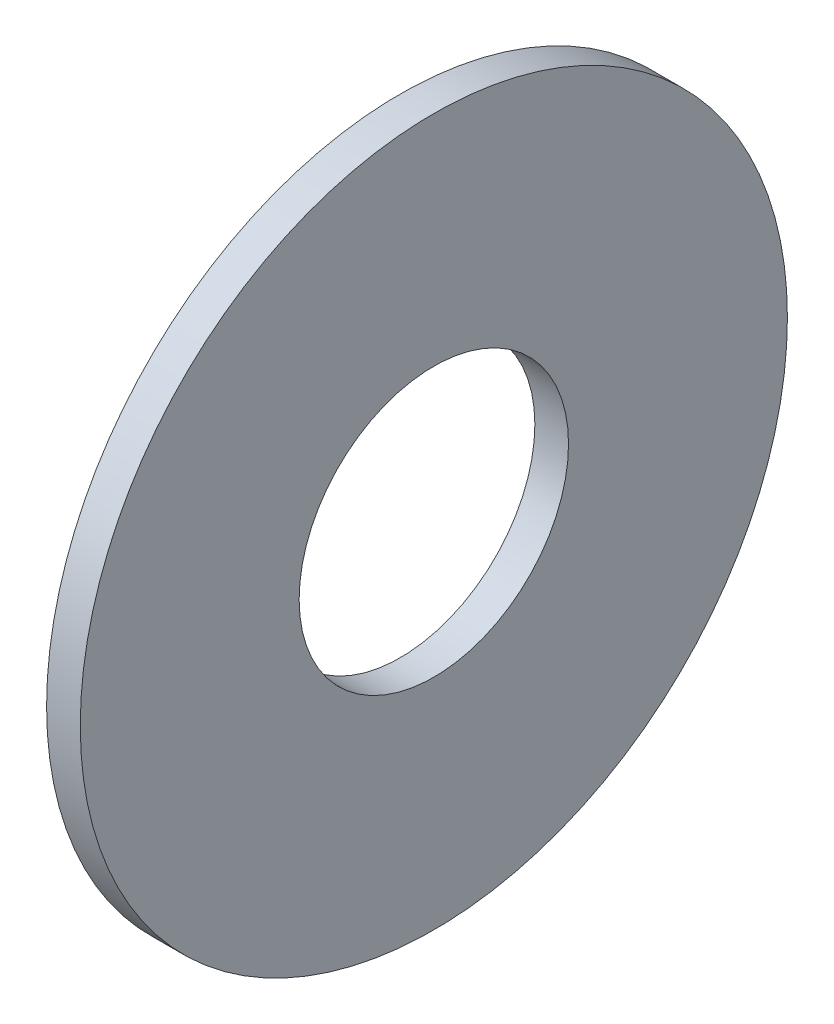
from build123d import *

# Parameters (mm, degrees)
ESQUISSE1_R      = 10.5
ESQUISSE1_R_2    = 4
EXTRUSION1_DEPTH = 1


with BuildPart() as part:
    # Esquisse1 → Extrusion1 (new body)
    with BuildSketch(Plane(origin=(0, 0, 0), x_dir=(0, 0, -1), z_dir=(1, 0, 0))):
        Circle(ESQUISSE1_R)
        Circle(ESQUISSE1_R_2, mode=Mode.SUBTRACT)
    extrude(amount=EXTRUSION1_DEPTH)


solid = part.part
